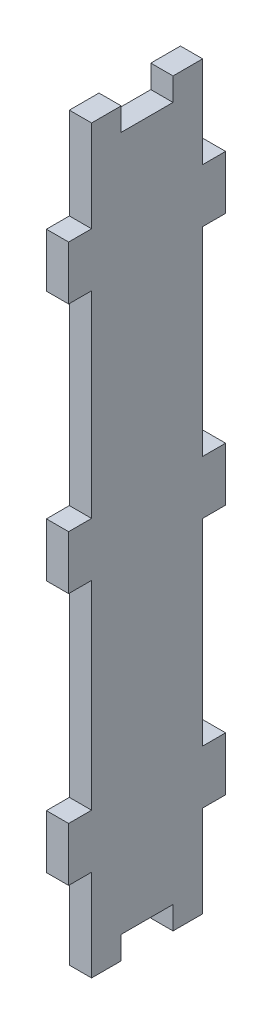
ISO-10303-21;
HEADER;
FILE_DESCRIPTION(('STEP AP214'),'2;1');
FILE_NAME('part.step','',(''),(''),'','','');
FILE_SCHEMA(('AUTOMOTIVE_DESIGN { 1 0 10303 214 1 1 1 1 }'));
ENDSEC;
DATA;
#1=APPLICATION_CONTEXT('core data for automotive mechanical design processes');
#2=APPLICATION_PROTOCOL_DEFINITION('international standard','automotive_design',2000,#1);
#3=PRODUCT_CONTEXT('',#1,'mechanical');
#4=PRODUCT('Part','Part','',(#3));
#5=PRODUCT_RELATED_PRODUCT_CATEGORY('part','',(#4));
#6=PRODUCT_DEFINITION_FORMATION('','',#4);
#7=PRODUCT_DEFINITION_CONTEXT('part definition',#1,'design');
#8=PRODUCT_DEFINITION('design','',#6,#7);
#9=PRODUCT_DEFINITION_SHAPE('','',#8);
#10=(LENGTH_UNIT() NAMED_UNIT(*) SI_UNIT(.MILLI.,.METRE.));
#11=(NAMED_UNIT(*) PLANE_ANGLE_UNIT() SI_UNIT($,.RADIAN.));
#12=(NAMED_UNIT(*) SI_UNIT($,.STERADIAN.) SOLID_ANGLE_UNIT());
#13=UNCERTAINTY_MEASURE_WITH_UNIT(LENGTH_MEASURE(1.E-05),#10,'distance_accuracy_value','');
#14=(GEOMETRIC_REPRESENTATION_CONTEXT(3) GLOBAL_UNCERTAINTY_ASSIGNED_CONTEXT((#13)) GLOBAL_UNIT_ASSIGNED_CONTEXT((#10,
#11,#12)) REPRESENTATION_CONTEXT('',''));
#15=CARTESIAN_POINT('',(0.,0.,0.));
#16=DIRECTION('',(0.,0.,1.));
#17=DIRECTION('',(1.,0.,0.));
#18=AXIS2_PLACEMENT_3D('',#15,#16,#17);
#19=CARTESIAN_POINT('',(6.,-100.,15.));
#20=DIRECTION('',(0.,1.,0.));
#21=DIRECTION('',(0.,0.,1.));
#22=AXIS2_PLACEMENT_3D('',#19,#20,#21);
#23=PLANE('',#22);
#24=DIRECTION('',(0.,0.,-1.));
#25=VECTOR('',#24,1.);
#26=CARTESIAN_POINT('',(0.,-100.,15.));
#27=LINE('',#26,#25);
#28=CARTESIAN_POINT('',(0.,-100.,15.));
#29=VERTEX_POINT('',#28);
#30=CARTESIAN_POINT('',(0.,-100.,6.9999999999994));
#31=VERTEX_POINT('',#30);
#32=EDGE_CURVE('E514',#29,#31,#27,.T.);
#33=ORIENTED_EDGE('',*,*,#32,.T.);
#34=DIRECTION('',(1.,0.,0.));
#35=VECTOR('',#34,1.);
#36=CARTESIAN_POINT('',(0.,-100.,6.9999999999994));
#37=LINE('',#36,#35);
#38=CARTESIAN_POINT('',(6.,-100.,6.9999999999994));
#39=VERTEX_POINT('',#38);
#40=EDGE_CURVE('E315',#31,#39,#37,.T.);
#41=ORIENTED_EDGE('',*,*,#40,.T.);
#42=DIRECTION('',(0.,0.,-1.));
#43=VECTOR('',#42,1.);
#44=CARTESIAN_POINT('',(6.,-100.,15.));
#45=LINE('',#44,#43);
#46=CARTESIAN_POINT('',(6.,-100.,15.));
#47=VERTEX_POINT('',#46);
#48=EDGE_CURVE('E496',#47,#39,#45,.T.);
#49=ORIENTED_EDGE('',*,*,#48,.F.);
#50=DIRECTION('',(-1.,0.,0.));
#51=VECTOR('',#50,1.);
#52=CARTESIAN_POINT('',(6.,-100.,15.));
#53=LINE('',#52,#51);
#54=EDGE_CURVE('E11',#47,#29,#53,.T.);
#55=ORIENTED_EDGE('',*,*,#54,.T.);
#56=EDGE_LOOP('',(#33,#41,#49,#55));
#57=FACE_BOUND('',#56,.T.);
#58=ADVANCED_FACE('F37',(#57),#23,.F.);
#59=CARTESIAN_POINT('',(6.,100.,15.));
#60=DIRECTION('',(0.,-1.,0.));
#61=DIRECTION('',(0.,0.,-1.));
#62=AXIS2_PLACEMENT_3D('',#59,#60,#61);
#63=PLANE('',#62);
#64=DIRECTION('',(0.,0.,1.));
#65=VECTOR('',#64,1.);
#66=CARTESIAN_POINT('',(6.,100.,15.));
#67=LINE('',#66,#65);
#68=CARTESIAN_POINT('',(6.,100.,7.));
#69=VERTEX_POINT('',#68);
#70=CARTESIAN_POINT('',(6.,100.,15.));
#71=VERTEX_POINT('',#70);
#72=EDGE_CURVE('E503',#69,#71,#67,.T.);
#73=ORIENTED_EDGE('',*,*,#72,.F.);
#74=DIRECTION('',(1.,0.,0.));
#75=VECTOR('',#74,1.);
#76=CARTESIAN_POINT('',(0.,100.,7.));
#77=LINE('',#76,#75);
#78=CARTESIAN_POINT('',(0.,100.,7.));
#79=VERTEX_POINT('',#78);
#80=EDGE_CURVE('E300',#79,#69,#77,.T.);
#81=ORIENTED_EDGE('',*,*,#80,.F.);
#82=DIRECTION('',(0.,0.,1.));
#83=VECTOR('',#82,1.);
#84=CARTESIAN_POINT('',(0.,100.,15.));
#85=LINE('',#84,#83);
#86=CARTESIAN_POINT('',(0.,100.,15.));
#87=VERTEX_POINT('',#86);
#88=EDGE_CURVE('E290',#79,#87,#85,.T.);
#89=ORIENTED_EDGE('',*,*,#88,.T.);
#90=DIRECTION('',(-1.,0.,0.));
#91=VECTOR('',#90,1.);
#92=CARTESIAN_POINT('',(6.,100.,15.));
#93=LINE('',#92,#91);
#94=EDGE_CURVE('E508',#71,#87,#93,.T.);
#95=ORIENTED_EDGE('',*,*,#94,.F.);
#96=EDGE_LOOP('',(#73,#81,#89,#95));
#97=FACE_BOUND('',#96,.T.);
#98=ADVANCED_FACE('F616',(#97),#63,.F.);
#99=CARTESIAN_POINT('',(6.,100.,-15.));
#100=DIRECTION('',(0.,0.,1.));
#101=DIRECTION('',(0.,-1.,0.));
#102=AXIS2_PLACEMENT_3D('',#99,#100,#101);
#103=PLANE('',#102);
#104=DIRECTION('',(0.,1.,0.));
#105=VECTOR('',#104,1.);
#106=CARTESIAN_POINT('',(6.,100.,-15.));
#107=LINE('',#106,#105);
#108=CARTESIAN_POINT('',(6.,75.2499999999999,-15.));
#109=VERTEX_POINT('',#108);
#110=CARTESIAN_POINT('',(6.,100.,-15.));
#111=VERTEX_POINT('',#110);
#112=EDGE_CURVE('E499',#109,#111,#107,.T.);
#113=ORIENTED_EDGE('',*,*,#112,.F.);
#114=DIRECTION('',(1.,0.,0.));
#115=VECTOR('',#114,1.);
#116=CARTESIAN_POINT('',(0.,75.2499999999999,-14.9999999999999));
#117=LINE('',#116,#115);
#118=CARTESIAN_POINT('',(0.,75.2499999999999,-14.9999999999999));
#119=VERTEX_POINT('',#118);
#120=EDGE_CURVE('E340',#119,#109,#117,.T.);
#121=ORIENTED_EDGE('',*,*,#120,.F.);
#122=DIRECTION('',(0.,1.,0.));
#123=VECTOR('',#122,1.);
#124=CARTESIAN_POINT('',(0.,100.,-15.));
#125=LINE('',#124,#123);
#126=CARTESIAN_POINT('',(0.,100.,-15.));
#127=VERTEX_POINT('',#126);
#128=EDGE_CURVE('E517',#119,#127,#125,.T.);
#129=ORIENTED_EDGE('',*,*,#128,.T.);
#130=DIRECTION('',(-1.,0.,0.));
#131=VECTOR('',#130,1.);
#132=CARTESIAN_POINT('',(6.,100.,-15.));
#133=LINE('',#132,#131);
#134=EDGE_CURVE('E527',#111,#127,#133,.T.);
#135=ORIENTED_EDGE('',*,*,#134,.F.);
#136=EDGE_LOOP('',(#113,#121,#129,#135));
#137=FACE_BOUND('',#136,.T.);
#138=ADVANCED_FACE('F620',(#137),#103,.F.);
#139=CARTESIAN_POINT('',(0.,6.99999999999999,-14.9999999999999));
#140=VERTEX_POINT('',#139);
#141=CARTESIAN_POINT('',(0.,60.75,-15.));
#142=VERTEX_POINT('',#141);
#143=EDGE_CURVE('E675',#140,#142,#125,.T.);
#144=ORIENTED_EDGE('',*,*,#143,.T.);
#145=DIRECTION('',(1.,0.,0.));
#146=VECTOR('',#145,1.);
#147=CARTESIAN_POINT('',(0.,60.75,-15.0000000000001));
#148=LINE('',#147,#146);
#149=CARTESIAN_POINT('',(6.,60.75,-15.));
#150=VERTEX_POINT('',#149);
#151=EDGE_CURVE('E353',#142,#150,#148,.T.);
#152=ORIENTED_EDGE('',*,*,#151,.T.);
#153=CARTESIAN_POINT('',(6.,6.99999999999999,-15.));
#154=VERTEX_POINT('',#153);
#155=EDGE_CURVE('E690',#154,#150,#107,.T.);
#156=ORIENTED_EDGE('',*,*,#155,.F.);
#157=DIRECTION('',(1.,0.,0.));
#158=VECTOR('',#157,1.);
#159=CARTESIAN_POINT('',(0.,6.99999999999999,-14.9999999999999));
#160=LINE('',#159,#158);
#161=EDGE_CURVE('E367',#140,#154,#160,.T.);
#162=ORIENTED_EDGE('',*,*,#161,.F.);
#163=EDGE_LOOP('',(#144,#152,#156,#162));
#164=FACE_BOUND('',#163,.T.);
#165=ADVANCED_FACE('F640',(#164),#103,.F.);
#166=CARTESIAN_POINT('',(0.,-60.7500000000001,-14.9999999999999));
#167=VERTEX_POINT('',#166);
#168=CARTESIAN_POINT('',(0.,-7.49999999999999,-15.));
#169=VERTEX_POINT('',#168);
#170=EDGE_CURVE('E521',#167,#169,#125,.T.);
#171=ORIENTED_EDGE('',*,*,#170,.T.);
#172=DIRECTION('',(1.,0.,0.));
#173=VECTOR('',#172,1.);
#174=CARTESIAN_POINT('',(0.,-7.49999999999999,-15.0000000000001));
#175=LINE('',#174,#173);
#176=CARTESIAN_POINT('',(6.,-7.49999999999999,-15.));
#177=VERTEX_POINT('',#176);
#178=EDGE_CURVE('E380',#169,#177,#175,.T.);
#179=ORIENTED_EDGE('',*,*,#178,.T.);
#180=CARTESIAN_POINT('',(6.,-60.7500000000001,-14.9999999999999));
#181=VERTEX_POINT('',#180);
#182=EDGE_CURVE('E504',#181,#177,#107,.T.);
#183=ORIENTED_EDGE('',*,*,#182,.F.);
#184=DIRECTION('',(1.,0.,0.));
#185=VECTOR('',#184,1.);
#186=CARTESIAN_POINT('',(0.,-60.7500000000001,-14.9999999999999));
#187=LINE('',#186,#185);
#188=EDGE_CURVE('E393',#167,#181,#187,.T.);
#189=ORIENTED_EDGE('',*,*,#188,.F.);
#190=EDGE_LOOP('',(#171,#179,#183,#189));
#191=FACE_BOUND('',#190,.T.);
#192=ADVANCED_FACE('F630',(#191),#103,.F.);
#193=CARTESIAN_POINT('',(6.,100.,15.));
#194=DIRECTION('',(0.,0.,-1.));
#195=DIRECTION('',(0.,1.,0.));
#196=AXIS2_PLACEMENT_3D('',#193,#194,#195);
#197=PLANE('',#196);
#198=DIRECTION('',(0.,-1.,0.));
#199=VECTOR('',#198,1.);
#200=CARTESIAN_POINT('',(6.,100.,15.));
#201=LINE('',#200,#199);
#202=CARTESIAN_POINT('',(6.,-75.25,15.));
#203=VERTEX_POINT('',#202);
#204=EDGE_CURVE('E495',#203,#47,#201,.T.);
#205=ORIENTED_EDGE('',*,*,#204,.F.);
#206=DIRECTION('',(1.,0.,0.));
#207=VECTOR('',#206,1.);
#208=CARTESIAN_POINT('',(0.,-75.25,14.9999999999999));
#209=LINE('',#208,#207);
#210=CARTESIAN_POINT('',(0.,-75.25,14.9999999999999));
#211=VERTEX_POINT('',#210);
#212=EDGE_CURVE('E420',#211,#203,#209,.T.);
#213=ORIENTED_EDGE('',*,*,#212,.F.);
#214=DIRECTION('',(0.,-1.,0.));
#215=VECTOR('',#214,1.);
#216=CARTESIAN_POINT('',(0.,100.,15.));
#217=LINE('',#216,#215);
#218=EDGE_CURVE('E483',#211,#29,#217,.T.);
#219=ORIENTED_EDGE('',*,*,#218,.T.);
#220=ORIENTED_EDGE('',*,*,#54,.F.);
#221=EDGE_LOOP('',(#205,#213,#219,#220));
#222=FACE_BOUND('',#221,.T.);
#223=ADVANCED_FACE('F559',(#222),#197,.F.);
#224=CARTESIAN_POINT('',(0.,-6.99999999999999,14.9999999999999));
#225=VERTEX_POINT('',#224);
#226=CARTESIAN_POINT('',(0.,-60.75,15.));
#227=VERTEX_POINT('',#226);
#228=EDGE_CURVE('E562',#225,#227,#217,.T.);
#229=ORIENTED_EDGE('',*,*,#228,.T.);
#230=DIRECTION('',(1.,0.,0.));
#231=VECTOR('',#230,1.);
#232=CARTESIAN_POINT('',(0.,-60.75,15.));
#233=LINE('',#232,#231);
#234=CARTESIAN_POINT('',(6.,-60.75,15.));
#235=VERTEX_POINT('',#234);
#236=EDGE_CURVE('E433',#227,#235,#233,.T.);
#237=ORIENTED_EDGE('',*,*,#236,.T.);
#238=CARTESIAN_POINT('',(6.,-6.99999999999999,15.));
#239=VERTEX_POINT('',#238);
#240=EDGE_CURVE('E585',#239,#235,#201,.T.);
#241=ORIENTED_EDGE('',*,*,#240,.F.);
#242=DIRECTION('',(1.,0.,0.));
#243=VECTOR('',#242,1.);
#244=CARTESIAN_POINT('',(0.,-6.99999999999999,14.9999999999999));
#245=LINE('',#244,#243);
#246=EDGE_CURVE('E447',#225,#239,#245,.T.);
#247=ORIENTED_EDGE('',*,*,#246,.F.);
#248=EDGE_LOOP('',(#229,#237,#241,#247));
#249=FACE_BOUND('',#248,.T.);
#250=ADVANCED_FACE('F599',(#249),#197,.F.);
#251=CARTESIAN_POINT('',(0.,60.75,14.9999999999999));
#252=VERTEX_POINT('',#251);
#253=CARTESIAN_POINT('',(0.,7.49999999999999,15.));
#254=VERTEX_POINT('',#253);
#255=EDGE_CURVE('E513',#252,#254,#217,.T.);
#256=ORIENTED_EDGE('',*,*,#255,.T.);
#257=DIRECTION('',(1.,0.,0.));
#258=VECTOR('',#257,1.);
#259=CARTESIAN_POINT('',(0.,7.49999999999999,15.));
#260=LINE('',#259,#258);
#261=CARTESIAN_POINT('',(6.,7.49999999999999,15.));
#262=VERTEX_POINT('',#261);
#263=EDGE_CURVE('E460',#254,#262,#260,.T.);
#264=ORIENTED_EDGE('',*,*,#263,.T.);
#265=CARTESIAN_POINT('',(6.,60.75,14.9999999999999));
#266=VERTEX_POINT('',#265);
#267=EDGE_CURVE('E494',#266,#262,#201,.T.);
#268=ORIENTED_EDGE('',*,*,#267,.F.);
#269=DIRECTION('',(1.,0.,0.));
#270=VECTOR('',#269,1.);
#271=CARTESIAN_POINT('',(0.,60.75,14.9999999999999));
#272=LINE('',#271,#270);
#273=EDGE_CURVE('E473',#252,#266,#272,.T.);
#274=ORIENTED_EDGE('',*,*,#273,.F.);
#275=EDGE_LOOP('',(#256,#264,#268,#274));
#276=FACE_BOUND('',#275,.T.);
#277=ADVANCED_FACE('F570',(#276),#197,.F.);
#278=CARTESIAN_POINT('',(0.,75.25,15.));
#279=VERTEX_POINT('',#278);
#280=EDGE_CURVE('E509',#87,#279,#217,.T.);
#281=ORIENTED_EDGE('',*,*,#280,.T.);
#282=DIRECTION('',(1.,0.,0.));
#283=VECTOR('',#282,1.);
#284=CARTESIAN_POINT('',(0.,75.25,15.));
#285=LINE('',#284,#283);
#286=CARTESIAN_POINT('',(6.,75.25,15.));
#287=VERTEX_POINT('',#286);
#288=EDGE_CURVE('E486',#279,#287,#285,.T.);
#289=ORIENTED_EDGE('',*,*,#288,.T.);
#290=EDGE_CURVE('E490',#71,#287,#201,.T.);
#291=ORIENTED_EDGE('',*,*,#290,.F.);
#292=ORIENTED_EDGE('',*,*,#94,.T.);
#293=EDGE_LOOP('',(#281,#289,#291,#292));
#294=FACE_BOUND('',#293,.T.);
#295=ADVANCED_FACE('F39',(#294),#197,.F.);
#296=CARTESIAN_POINT('',(6.,-99.9999999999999,-7.00000000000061));
#297=VERTEX_POINT('',#296);
#298=CARTESIAN_POINT('',(6.,-100.,-15.));
#299=VERTEX_POINT('',#298);
#300=EDGE_CURVE('E493',#297,#299,#45,.T.);
#301=ORIENTED_EDGE('',*,*,#300,.F.);
#302=DIRECTION('',(1.,0.,0.));
#303=VECTOR('',#302,1.);
#304=CARTESIAN_POINT('',(0.,-99.9999999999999,-7.00000000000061));
#305=LINE('',#304,#303);
#306=CARTESIAN_POINT('',(0.,-99.9999999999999,-7.00000000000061));
#307=VERTEX_POINT('',#306);
#308=EDGE_CURVE('E326',#307,#297,#305,.T.);
#309=ORIENTED_EDGE('',*,*,#308,.F.);
#310=CARTESIAN_POINT('',(0.,-100.,-15.));
#311=VERTEX_POINT('',#310);
#312=EDGE_CURVE('E512',#307,#311,#27,.T.);
#313=ORIENTED_EDGE('',*,*,#312,.T.);
#314=DIRECTION('',(-1.,0.,0.));
#315=VECTOR('',#314,1.);
#316=CARTESIAN_POINT('',(6.,-100.,-15.));
#317=LINE('',#316,#315);
#318=EDGE_CURVE('E45',#299,#311,#317,.T.);
#319=ORIENTED_EDGE('',*,*,#318,.F.);
#320=EDGE_LOOP('',(#301,#309,#313,#319));
#321=FACE_BOUND('',#320,.T.);
#322=ADVANCED_FACE('F549',(#321),#23,.F.);
#323=CARTESIAN_POINT('',(0.,-75.2500000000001,-15.0000000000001));
#324=VERTEX_POINT('',#323);
#325=EDGE_CURVE('E518',#311,#324,#125,.T.);
#326=ORIENTED_EDGE('',*,*,#325,.T.);
#327=DIRECTION('',(1.,0.,0.));
#328=VECTOR('',#327,1.);
#329=CARTESIAN_POINT('',(0.,-75.2500000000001,-15.0000000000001));
#330=LINE('',#329,#328);
#331=CARTESIAN_POINT('',(6.,-75.2500000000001,-15.));
#332=VERTEX_POINT('',#331);
#333=EDGE_CURVE('E406',#324,#332,#330,.T.);
#334=ORIENTED_EDGE('',*,*,#333,.T.);
#335=EDGE_CURVE('E500',#299,#332,#107,.T.);
#336=ORIENTED_EDGE('',*,*,#335,.F.);
#337=ORIENTED_EDGE('',*,*,#318,.T.);
#338=EDGE_LOOP('',(#326,#334,#336,#337));
#339=FACE_BOUND('',#338,.T.);
#340=ADVANCED_FACE('F534',(#339),#103,.F.);
#341=CARTESIAN_POINT('',(0.,100.,-7.));
#342=VERTEX_POINT('',#341);
#343=EDGE_CURVE('E522',#127,#342,#85,.T.);
#344=ORIENTED_EDGE('',*,*,#343,.T.);
#345=DIRECTION('',(1.,0.,0.));
#346=VECTOR('',#345,1.);
#347=CARTESIAN_POINT('',(0.,100.,-7.));
#348=LINE('',#347,#346);
#349=CARTESIAN_POINT('',(6.,100.,-7.));
#350=VERTEX_POINT('',#349);
#351=EDGE_CURVE('E303',#342,#350,#348,.T.);
#352=ORIENTED_EDGE('',*,*,#351,.T.);
#353=EDGE_CURVE('E505',#111,#350,#67,.T.);
#354=ORIENTED_EDGE('',*,*,#353,.F.);
#355=ORIENTED_EDGE('',*,*,#134,.T.);
#356=EDGE_LOOP('',(#344,#352,#354,#355));
#357=FACE_BOUND('',#356,.T.);
#358=ADVANCED_FACE('F623',(#357),#63,.F.);
#359=CARTESIAN_POINT('',(6.,0.,0.));
#360=DIRECTION('',(1.,0.,0.));
#361=DIRECTION('',(0.,0.,-1.));
#362=AXIS2_PLACEMENT_3D('',#359,#360,#361);
#363=PLANE('',#362);
#364=DIRECTION('',(0.,-1.,0.));
#365=VECTOR('',#364,1.);
#366=CARTESIAN_POINT('',(6.,100.,7.));
#367=LINE('',#366,#365);
#368=CARTESIAN_POINT('',(6.,93.8,7.));
#369=VERTEX_POINT('',#368);
#370=EDGE_CURVE('E276',#69,#369,#367,.T.);
#371=ORIENTED_EDGE('',*,*,#370,.F.);
#372=ORIENTED_EDGE('',*,*,#72,.T.);
#373=ORIENTED_EDGE('',*,*,#290,.T.);
#374=DIRECTION('',(0.,0.,1.));
#375=VECTOR('',#374,1.);
#376=CARTESIAN_POINT('',(6.,75.25,15.));
#377=LINE('',#376,#375);
#378=CARTESIAN_POINT('',(6.,75.25,21.2));
#379=VERTEX_POINT('',#378);
#380=EDGE_CURVE('E476',#287,#379,#377,.T.);
#381=ORIENTED_EDGE('',*,*,#380,.T.);
#382=DIRECTION('',(0.,-1.,0.));
#383=VECTOR('',#382,1.);
#384=CARTESIAN_POINT('',(6.,75.25,21.2));
#385=LINE('',#384,#383);
#386=CARTESIAN_POINT('',(6.,60.75,21.1999999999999));
#387=VERTEX_POINT('',#386);
#388=EDGE_CURVE('E467',#379,#387,#385,.T.);
#389=ORIENTED_EDGE('',*,*,#388,.T.);
#390=DIRECTION('',(0.,0.,-1.));
#391=VECTOR('',#390,1.);
#392=CARTESIAN_POINT('',(6.,60.75,21.1999999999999));
#393=LINE('',#392,#391);
#394=EDGE_CURVE('E457',#387,#266,#393,.T.);
#395=ORIENTED_EDGE('',*,*,#394,.T.);
#396=ORIENTED_EDGE('',*,*,#267,.T.);
#397=DIRECTION('',(0.,0.,1.));
#398=VECTOR('',#397,1.);
#399=CARTESIAN_POINT('',(6.,7.49999999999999,15.));
#400=LINE('',#399,#398);
#401=CARTESIAN_POINT('',(6.,7.49999999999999,21.2));
#402=VERTEX_POINT('',#401);
#403=EDGE_CURVE('E450',#262,#402,#400,.T.);
#404=ORIENTED_EDGE('',*,*,#403,.T.);
#405=DIRECTION('',(0.,-1.,0.));
#406=VECTOR('',#405,1.);
#407=CARTESIAN_POINT('',(6.,7.49999999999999,21.2));
#408=LINE('',#407,#406);
#409=CARTESIAN_POINT('',(6.,-7.00000000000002,21.1999999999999));
#410=VERTEX_POINT('',#409);
#411=EDGE_CURVE('E441',#402,#410,#408,.T.);
#412=ORIENTED_EDGE('',*,*,#411,.T.);
#413=DIRECTION('',(0.,0.,-1.));
#414=VECTOR('',#413,1.);
#415=CARTESIAN_POINT('',(6.,-7.00000000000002,21.1999999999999));
#416=LINE('',#415,#414);
#417=EDGE_CURVE('E430',#410,#239,#416,.T.);
#418=ORIENTED_EDGE('',*,*,#417,.T.);
#419=ORIENTED_EDGE('',*,*,#240,.T.);
#420=DIRECTION('',(0.,0.,1.));
#421=VECTOR('',#420,1.);
#422=CARTESIAN_POINT('',(6.,-60.75,15.));
#423=LINE('',#422,#421);
#424=CARTESIAN_POINT('',(6.,-60.75,21.2));
#425=VERTEX_POINT('',#424);
#426=EDGE_CURVE('E423',#235,#425,#423,.T.);
#427=ORIENTED_EDGE('',*,*,#426,.T.);
#428=DIRECTION('',(0.,-1.,0.));
#429=VECTOR('',#428,1.);
#430=CARTESIAN_POINT('',(6.,-60.75,21.2));
#431=LINE('',#430,#429);
#432=CARTESIAN_POINT('',(6.,-75.25,21.1999999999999));
#433=VERTEX_POINT('',#432);
#434=EDGE_CURVE('E414',#425,#433,#431,.T.);
#435=ORIENTED_EDGE('',*,*,#434,.T.);
#436=DIRECTION('',(0.,0.,-1.));
#437=VECTOR('',#436,1.);
#438=CARTESIAN_POINT('',(6.,-75.25,21.1999999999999));
#439=LINE('',#438,#437);
#440=EDGE_CURVE('E403',#433,#203,#439,.T.);
#441=ORIENTED_EDGE('',*,*,#440,.T.);
#442=ORIENTED_EDGE('',*,*,#204,.T.);
#443=ORIENTED_EDGE('',*,*,#48,.T.);
#444=DIRECTION('',(0.,-1.,0.));
#445=VECTOR('',#444,1.);
#446=CARTESIAN_POINT('',(6.,-100.,6.9999999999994));
#447=LINE('',#446,#445);
#448=CARTESIAN_POINT('',(6.,-93.8000000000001,6.99999999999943));
#449=VERTEX_POINT('',#448);
#450=EDGE_CURVE('E316',#449,#39,#447,.T.);
#451=ORIENTED_EDGE('',*,*,#450,.F.);
#452=DIRECTION('',(0.,0.,1.));
#453=VECTOR('',#452,1.);
#454=CARTESIAN_POINT('',(6.,-93.8000000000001,6.99999999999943));
#455=LINE('',#454,#453);
#456=CARTESIAN_POINT('',(6.,-93.8,-7.00000000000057));
#457=VERTEX_POINT('',#456);
#458=EDGE_CURVE('E311',#457,#449,#455,.T.);
#459=ORIENTED_EDGE('',*,*,#458,.F.);
#460=DIRECTION('',(0.,1.,0.));
#461=VECTOR('',#460,1.);
#462=CARTESIAN_POINT('',(6.,-99.9999999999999,-7.00000000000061));
#463=LINE('',#462,#461);
#464=EDGE_CURVE('E318',#297,#457,#463,.T.);
#465=ORIENTED_EDGE('',*,*,#464,.F.);
#466=ORIENTED_EDGE('',*,*,#300,.T.);
#467=ORIENTED_EDGE('',*,*,#335,.T.);
#468=DIRECTION('',(0.,0.,-1.));
#469=VECTOR('',#468,1.);
#470=CARTESIAN_POINT('',(6.,-75.2500000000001,-15.0000000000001));
#471=LINE('',#470,#469);
#472=CARTESIAN_POINT('',(6.,-75.25,-21.2));
#473=VERTEX_POINT('',#472);
#474=EDGE_CURVE('E396',#332,#473,#471,.T.);
#475=ORIENTED_EDGE('',*,*,#474,.T.);
#476=DIRECTION('',(0.,1.,0.));
#477=VECTOR('',#476,1.);
#478=CARTESIAN_POINT('',(6.,-75.25,-21.2));
#479=LINE('',#478,#477);
#480=CARTESIAN_POINT('',(6.,-60.75,-21.1999999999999));
#481=VERTEX_POINT('',#480);
#482=EDGE_CURVE('E387',#473,#481,#479,.T.);
#483=ORIENTED_EDGE('',*,*,#482,.T.);
#484=DIRECTION('',(0.,0.,1.));
#485=VECTOR('',#484,1.);
#486=CARTESIAN_POINT('',(6.,-60.75,-21.1999999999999));
#487=LINE('',#486,#485);
#488=EDGE_CURVE('E377',#481,#181,#487,.T.);
#489=ORIENTED_EDGE('',*,*,#488,.T.);
#490=ORIENTED_EDGE('',*,*,#182,.T.);
#491=DIRECTION('',(0.,0.,-1.));
#492=VECTOR('',#491,1.);
#493=CARTESIAN_POINT('',(6.,-7.49999999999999,-15.0000000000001));
#494=LINE('',#493,#492);
#495=CARTESIAN_POINT('',(6.,-7.49999999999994,-21.2));
#496=VERTEX_POINT('',#495);
#497=EDGE_CURVE('E370',#177,#496,#494,.T.);
#498=ORIENTED_EDGE('',*,*,#497,.T.);
#499=DIRECTION('',(0.,1.,0.));
#500=VECTOR('',#499,1.);
#501=CARTESIAN_POINT('',(6.,-7.49999999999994,-21.2));
#502=LINE('',#501,#500);
#503=CARTESIAN_POINT('',(6.,7.00000000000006,-21.1999999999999));
#504=VERTEX_POINT('',#503);
#505=EDGE_CURVE('E361',#496,#504,#502,.T.);
#506=ORIENTED_EDGE('',*,*,#505,.T.);
#507=DIRECTION('',(0.,0.,1.));
#508=VECTOR('',#507,1.);
#509=CARTESIAN_POINT('',(6.,7.00000000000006,-21.1999999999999));
#510=LINE('',#509,#508);
#511=EDGE_CURVE('E350',#504,#154,#510,.T.);
#512=ORIENTED_EDGE('',*,*,#511,.T.);
#513=ORIENTED_EDGE('',*,*,#155,.T.);
#514=DIRECTION('',(0.,0.,-1.));
#515=VECTOR('',#514,1.);
#516=CARTESIAN_POINT('',(6.,60.75,-15.0000000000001));
#517=LINE('',#516,#515);
#518=CARTESIAN_POINT('',(6.,60.75,-21.2));
#519=VERTEX_POINT('',#518);
#520=EDGE_CURVE('E343',#150,#519,#517,.T.);
#521=ORIENTED_EDGE('',*,*,#520,.T.);
#522=DIRECTION('',(0.,1.,0.));
#523=VECTOR('',#522,1.);
#524=CARTESIAN_POINT('',(6.,60.75,-21.2));
#525=LINE('',#524,#523);
#526=CARTESIAN_POINT('',(6.,75.25,-21.1999999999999));
#527=VERTEX_POINT('',#526);
#528=EDGE_CURVE('E334',#519,#527,#525,.T.);
#529=ORIENTED_EDGE('',*,*,#528,.T.);
#530=DIRECTION('',(0.,0.,1.));
#531=VECTOR('',#530,1.);
#532=CARTESIAN_POINT('',(6.,75.25,-21.1999999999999));
#533=LINE('',#532,#531);
#534=EDGE_CURVE('E302',#527,#109,#533,.T.);
#535=ORIENTED_EDGE('',*,*,#534,.T.);
#536=ORIENTED_EDGE('',*,*,#112,.T.);
#537=ORIENTED_EDGE('',*,*,#353,.T.);
#538=DIRECTION('',(0.,1.,0.));
#539=VECTOR('',#538,1.);
#540=CARTESIAN_POINT('',(6.,100.,-7.));
#541=LINE('',#540,#539);
#542=CARTESIAN_POINT('',(6.,93.8,-7.));
#543=VERTEX_POINT('',#542);
#544=EDGE_CURVE('E291',#543,#350,#541,.T.);
#545=ORIENTED_EDGE('',*,*,#544,.F.);
#546=DIRECTION('',(0.,0.,-1.));
#547=VECTOR('',#546,1.);
#548=CARTESIAN_POINT('',(6.,93.8,7.));
#549=LINE('',#548,#547);
#550=EDGE_CURVE('E293',#369,#543,#549,.T.);
#551=ORIENTED_EDGE('',*,*,#550,.F.);
#552=EDGE_LOOP('',(#371,#372,#373,#381,#389,#395,#396,#404,#412,#418,#419,#427,#435,#441,#442,
#443,#451,#459,#465,#466,#467,#475,#483,#489,#490,#498,#506,#512,#513,#521,#529,#535,#536,#537,
#545,#551));
#553=FACE_BOUND('',#552,.T.);
#554=ADVANCED_FACE('F544',(#553),#363,.T.);
#555=CARTESIAN_POINT('',(0.,0.,0.));
#556=DIRECTION('',(1.,0.,0.));
#557=DIRECTION('',(0.,0.,-1.));
#558=AXIS2_PLACEMENT_3D('',#555,#556,#557);
#559=PLANE('',#558);
#560=ORIENTED_EDGE('',*,*,#88,.F.);
#561=DIRECTION('',(0.,-1.,0.));
#562=VECTOR('',#561,1.);
#563=CARTESIAN_POINT('',(0.,100.,7.));
#564=LINE('',#563,#562);
#565=CARTESIAN_POINT('',(0.,93.8,7.));
#566=VERTEX_POINT('',#565);
#567=EDGE_CURVE('E273',#79,#566,#564,.T.);
#568=ORIENTED_EDGE('',*,*,#567,.T.);
#569=DIRECTION('',(0.,0.,-1.));
#570=VECTOR('',#569,1.);
#571=CARTESIAN_POINT('',(0.,93.8,7.));
#572=LINE('',#571,#570);
#573=CARTESIAN_POINT('',(0.,93.8,-7.));
#574=VERTEX_POINT('',#573);
#575=EDGE_CURVE('E283',#566,#574,#572,.T.);
#576=ORIENTED_EDGE('',*,*,#575,.T.);
#577=DIRECTION('',(0.,1.,0.));
#578=VECTOR('',#577,1.);
#579=CARTESIAN_POINT('',(0.,100.,-7.));
#580=LINE('',#579,#578);
#581=EDGE_CURVE('E52',#574,#342,#580,.T.);
#582=ORIENTED_EDGE('',*,*,#581,.T.);
#583=ORIENTED_EDGE('',*,*,#343,.F.);
#584=ORIENTED_EDGE('',*,*,#128,.F.);
#585=DIRECTION('',(0.,0.,1.));
#586=VECTOR('',#585,1.);
#587=CARTESIAN_POINT('',(0.,75.25,-21.1999999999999));
#588=LINE('',#587,#586);
#589=CARTESIAN_POINT('',(0.,75.25,-21.1999999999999));
#590=VERTEX_POINT('',#589);
#591=EDGE_CURVE('E330',#590,#119,#588,.T.);
#592=ORIENTED_EDGE('',*,*,#591,.F.);
#593=DIRECTION('',(0.,1.,0.));
#594=VECTOR('',#593,1.);
#595=CARTESIAN_POINT('',(0.,60.75,-21.2));
#596=LINE('',#595,#594);
#597=CARTESIAN_POINT('',(0.,60.75,-21.2));
#598=VERTEX_POINT('',#597);
#599=EDGE_CURVE('E337',#598,#590,#596,.T.);
#600=ORIENTED_EDGE('',*,*,#599,.F.);
#601=DIRECTION('',(0.,0.,-1.));
#602=VECTOR('',#601,1.);
#603=CARTESIAN_POINT('',(0.,60.75,-15.0000000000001));
#604=LINE('',#603,#602);
#605=EDGE_CURVE('E333',#142,#598,#604,.T.);
#606=ORIENTED_EDGE('',*,*,#605,.F.);
#607=ORIENTED_EDGE('',*,*,#143,.F.);
#608=DIRECTION('',(0.,0.,1.));
#609=VECTOR('',#608,1.);
#610=CARTESIAN_POINT('',(0.,7.00000000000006,-21.1999999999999));
#611=LINE('',#610,#609);
#612=CARTESIAN_POINT('',(0.,7.00000000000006,-21.1999999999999));
#613=VERTEX_POINT('',#612);
#614=EDGE_CURVE('E357',#613,#140,#611,.T.);
#615=ORIENTED_EDGE('',*,*,#614,.F.);
#616=DIRECTION('',(0.,1.,0.));
#617=VECTOR('',#616,1.);
#618=CARTESIAN_POINT('',(0.,-7.49999999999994,-21.2));
#619=LINE('',#618,#617);
#620=CARTESIAN_POINT('',(0.,-7.49999999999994,-21.2));
#621=VERTEX_POINT('',#620);
#622=EDGE_CURVE('E364',#621,#613,#619,.T.);
#623=ORIENTED_EDGE('',*,*,#622,.F.);
#624=DIRECTION('',(0.,0.,-1.));
#625=VECTOR('',#624,1.);
#626=CARTESIAN_POINT('',(0.,-7.49999999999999,-15.0000000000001));
#627=LINE('',#626,#625);
#628=EDGE_CURVE('E360',#169,#621,#627,.T.);
#629=ORIENTED_EDGE('',*,*,#628,.F.);
#630=ORIENTED_EDGE('',*,*,#170,.F.);
#631=DIRECTION('',(0.,0.,1.));
#632=VECTOR('',#631,1.);
#633=CARTESIAN_POINT('',(0.,-60.75,-21.1999999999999));
#634=LINE('',#633,#632);
#635=CARTESIAN_POINT('',(0.,-60.75,-21.1999999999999));
#636=VERTEX_POINT('',#635);
#637=EDGE_CURVE('E384',#636,#167,#634,.T.);
#638=ORIENTED_EDGE('',*,*,#637,.F.);
#639=DIRECTION('',(0.,1.,0.));
#640=VECTOR('',#639,1.);
#641=CARTESIAN_POINT('',(0.,-75.25,-21.2));
#642=LINE('',#641,#640);
#643=CARTESIAN_POINT('',(0.,-75.25,-21.2));
#644=VERTEX_POINT('',#643);
#645=EDGE_CURVE('E390',#644,#636,#642,.T.);
#646=ORIENTED_EDGE('',*,*,#645,.F.);
#647=DIRECTION('',(0.,0.,-1.));
#648=VECTOR('',#647,1.);
#649=CARTESIAN_POINT('',(0.,-75.2500000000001,-15.0000000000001));
#650=LINE('',#649,#648);
#651=EDGE_CURVE('E386',#324,#644,#650,.T.);
#652=ORIENTED_EDGE('',*,*,#651,.F.);
#653=ORIENTED_EDGE('',*,*,#325,.F.);
#654=ORIENTED_EDGE('',*,*,#312,.F.);
#655=DIRECTION('',(0.,1.,0.));
#656=VECTOR('',#655,1.);
#657=CARTESIAN_POINT('',(0.,-99.9999999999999,-7.00000000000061));
#658=LINE('',#657,#656);
#659=CARTESIAN_POINT('',(0.,-93.8,-7.00000000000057));
#660=VERTEX_POINT('',#659);
#661=EDGE_CURVE('E310',#307,#660,#658,.T.);
#662=ORIENTED_EDGE('',*,*,#661,.T.);
#663=DIRECTION('',(0.,0.,1.));
#664=VECTOR('',#663,1.);
#665=CARTESIAN_POINT('',(0.,-93.8000000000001,6.99999999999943));
#666=LINE('',#665,#664);
#667=CARTESIAN_POINT('',(0.,-93.8000000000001,6.99999999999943));
#668=VERTEX_POINT('',#667);
#669=EDGE_CURVE('E60',#660,#668,#666,.T.);
#670=ORIENTED_EDGE('',*,*,#669,.T.);
#671=DIRECTION('',(0.,-1.,0.));
#672=VECTOR('',#671,1.);
#673=CARTESIAN_POINT('',(0.,-100.,6.9999999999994));
#674=LINE('',#673,#672);
#675=EDGE_CURVE('E307',#668,#31,#674,.T.);
#676=ORIENTED_EDGE('',*,*,#675,.T.);
#677=ORIENTED_EDGE('',*,*,#32,.F.);
#678=ORIENTED_EDGE('',*,*,#218,.F.);
#679=DIRECTION('',(0.,0.,-1.));
#680=VECTOR('',#679,1.);
#681=CARTESIAN_POINT('',(0.,-75.25,21.1999999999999));
#682=LINE('',#681,#680);
#683=CARTESIAN_POINT('',(0.,-75.25,21.1999999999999));
#684=VERTEX_POINT('',#683);
#685=EDGE_CURVE('E410',#684,#211,#682,.T.);
#686=ORIENTED_EDGE('',*,*,#685,.F.);
#687=DIRECTION('',(0.,-1.,0.));
#688=VECTOR('',#687,1.);
#689=CARTESIAN_POINT('',(0.,-60.75,21.2));
#690=LINE('',#689,#688);
#691=CARTESIAN_POINT('',(0.,-60.75,21.2));
#692=VERTEX_POINT('',#691);
#693=EDGE_CURVE('E417',#692,#684,#690,.T.);
#694=ORIENTED_EDGE('',*,*,#693,.F.);
#695=DIRECTION('',(0.,0.,1.));
#696=VECTOR('',#695,1.);
#697=CARTESIAN_POINT('',(0.,-60.75,15.));
#698=LINE('',#697,#696);
#699=EDGE_CURVE('E413',#227,#692,#698,.T.);
#700=ORIENTED_EDGE('',*,*,#699,.F.);
#701=ORIENTED_EDGE('',*,*,#228,.F.);
#702=DIRECTION('',(0.,0.,-1.));
#703=VECTOR('',#702,1.);
#704=CARTESIAN_POINT('',(0.,-7.00000000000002,21.1999999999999));
#705=LINE('',#704,#703);
#706=CARTESIAN_POINT('',(0.,-7.00000000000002,21.1999999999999));
#707=VERTEX_POINT('',#706);
#708=EDGE_CURVE('E437',#707,#225,#705,.T.);
#709=ORIENTED_EDGE('',*,*,#708,.F.);
#710=DIRECTION('',(0.,-1.,0.));
#711=VECTOR('',#710,1.);
#712=CARTESIAN_POINT('',(0.,7.49999999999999,21.2));
#713=LINE('',#712,#711);
#714=CARTESIAN_POINT('',(0.,7.49999999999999,21.2));
#715=VERTEX_POINT('',#714);
#716=EDGE_CURVE('E444',#715,#707,#713,.T.);
#717=ORIENTED_EDGE('',*,*,#716,.F.);
#718=DIRECTION('',(0.,0.,1.));
#719=VECTOR('',#718,1.);
#720=CARTESIAN_POINT('',(0.,7.49999999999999,15.));
#721=LINE('',#720,#719);
#722=EDGE_CURVE('E440',#254,#715,#721,.T.);
#723=ORIENTED_EDGE('',*,*,#722,.F.);
#724=ORIENTED_EDGE('',*,*,#255,.F.);
#725=DIRECTION('',(0.,0.,-1.));
#726=VECTOR('',#725,1.);
#727=CARTESIAN_POINT('',(0.,60.75,21.1999999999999));
#728=LINE('',#727,#726);
#729=CARTESIAN_POINT('',(0.,60.75,21.1999999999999));
#730=VERTEX_POINT('',#729);
#731=EDGE_CURVE('E464',#730,#252,#728,.T.);
#732=ORIENTED_EDGE('',*,*,#731,.F.);
#733=DIRECTION('',(0.,-1.,0.));
#734=VECTOR('',#733,1.);
#735=CARTESIAN_POINT('',(0.,75.25,21.2));
#736=LINE('',#735,#734);
#737=CARTESIAN_POINT('',(0.,75.25,21.2));
#738=VERTEX_POINT('',#737);
#739=EDGE_CURVE('E470',#738,#730,#736,.T.);
#740=ORIENTED_EDGE('',*,*,#739,.F.);
#741=DIRECTION('',(0.,0.,1.));
#742=VECTOR('',#741,1.);
#743=CARTESIAN_POINT('',(0.,75.25,15.));
#744=LINE('',#743,#742);
#745=EDGE_CURVE('E466',#279,#738,#744,.T.);
#746=ORIENTED_EDGE('',*,*,#745,.F.);
#747=ORIENTED_EDGE('',*,*,#280,.F.);
#748=EDGE_LOOP('',(#560,#568,#576,#582,#583,#584,#592,#600,#606,#607,#615,#623,#629,#630,#638,
#646,#652,#653,#654,#662,#670,#676,#677,#678,#686,#694,#700,#701,#709,#717,#723,#724,#732,#740,
#746,#747));
#749=FACE_BOUND('',#748,.T.);
#750=ADVANCED_FACE('F288',(#749),#559,.F.);
#751=CARTESIAN_POINT('',(0.,60.75,21.1999999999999));
#752=DIRECTION('',(0.,-1.,0.));
#753=DIRECTION('',(0.,0.,-1.));
#754=AXIS2_PLACEMENT_3D('',#751,#752,#753);
#755=PLANE('',#754);
#756=ORIENTED_EDGE('',*,*,#394,.F.);
#757=DIRECTION('',(1.,0.,0.));
#758=VECTOR('',#757,1.);
#759=CARTESIAN_POINT('',(0.,60.75,21.1999999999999));
#760=LINE('',#759,#758);
#761=EDGE_CURVE('E481',#730,#387,#760,.T.);
#762=ORIENTED_EDGE('',*,*,#761,.F.);
#763=ORIENTED_EDGE('',*,*,#731,.T.);
#764=ORIENTED_EDGE('',*,*,#273,.T.);
#765=EDGE_LOOP('',(#756,#762,#763,#764));
#766=FACE_BOUND('',#765,.T.);
#767=ADVANCED_FACE('F651',(#766),#755,.T.);
#768=CARTESIAN_POINT('',(0.,75.25,21.2));
#769=DIRECTION('',(0.,0.,1.));
#770=DIRECTION('',(0.,-1.,0.));
#771=AXIS2_PLACEMENT_3D('',#768,#769,#770);
#772=PLANE('',#771);
#773=ORIENTED_EDGE('',*,*,#388,.F.);
#774=DIRECTION('',(1.,0.,0.));
#775=VECTOR('',#774,1.);
#776=CARTESIAN_POINT('',(0.,75.25,21.2));
#777=LINE('',#776,#775);
#778=EDGE_CURVE('E484',#738,#379,#777,.T.);
#779=ORIENTED_EDGE('',*,*,#778,.F.);
#780=ORIENTED_EDGE('',*,*,#739,.T.);
#781=ORIENTED_EDGE('',*,*,#761,.T.);
#782=EDGE_LOOP('',(#773,#779,#780,#781));
#783=FACE_BOUND('',#782,.T.);
#784=ADVANCED_FACE('F610',(#783),#772,.T.);
#785=CARTESIAN_POINT('',(0.,75.25,15.));
#786=DIRECTION('',(0.,1.,0.));
#787=DIRECTION('',(0.,0.,1.));
#788=AXIS2_PLACEMENT_3D('',#785,#786,#787);
#789=PLANE('',#788);
#790=ORIENTED_EDGE('',*,*,#380,.F.);
#791=ORIENTED_EDGE('',*,*,#288,.F.);
#792=ORIENTED_EDGE('',*,*,#745,.T.);
#793=ORIENTED_EDGE('',*,*,#778,.T.);
#794=EDGE_LOOP('',(#790,#791,#792,#793));
#795=FACE_BOUND('',#794,.T.);
#796=ADVANCED_FACE('F603',(#795),#789,.T.);
#797=CARTESIAN_POINT('',(0.,-7.00000000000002,21.1999999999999));
#798=DIRECTION('',(0.,-1.,0.));
#799=DIRECTION('',(0.,0.,-1.));
#800=AXIS2_PLACEMENT_3D('',#797,#798,#799);
#801=PLANE('',#800);
#802=ORIENTED_EDGE('',*,*,#417,.F.);
#803=DIRECTION('',(1.,0.,0.));
#804=VECTOR('',#803,1.);
#805=CARTESIAN_POINT('',(0.,-7.00000000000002,21.1999999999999));
#806=LINE('',#805,#804);
#807=EDGE_CURVE('E455',#707,#410,#806,.T.);
#808=ORIENTED_EDGE('',*,*,#807,.F.);
#809=ORIENTED_EDGE('',*,*,#708,.T.);
#810=ORIENTED_EDGE('',*,*,#246,.T.);
#811=EDGE_LOOP('',(#802,#808,#809,#810));
#812=FACE_BOUND('',#811,.T.);
#813=ADVANCED_FACE('F601',(#812),#801,.T.);
#814=CARTESIAN_POINT('',(0.,7.49999999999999,21.2));
#815=DIRECTION('',(0.,0.,1.));
#816=DIRECTION('',(0.,-1.,0.));
#817=AXIS2_PLACEMENT_3D('',#814,#815,#816);
#818=PLANE('',#817);
#819=ORIENTED_EDGE('',*,*,#411,.F.);
#820=DIRECTION('',(1.,0.,0.));
#821=VECTOR('',#820,1.);
#822=CARTESIAN_POINT('',(0.,7.49999999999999,21.2));
#823=LINE('',#822,#821);
#824=EDGE_CURVE('E458',#715,#402,#823,.T.);
#825=ORIENTED_EDGE('',*,*,#824,.F.);
#826=ORIENTED_EDGE('',*,*,#716,.T.);
#827=ORIENTED_EDGE('',*,*,#807,.T.);
#828=EDGE_LOOP('',(#819,#825,#826,#827));
#829=FACE_BOUND('',#828,.T.);
#830=ADVANCED_FACE('F582',(#829),#818,.T.);
#831=CARTESIAN_POINT('',(0.,7.49999999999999,15.));
#832=DIRECTION('',(0.,1.,0.));
#833=DIRECTION('',(0.,0.,1.));
#834=AXIS2_PLACEMENT_3D('',#831,#832,#833);
#835=PLANE('',#834);
#836=ORIENTED_EDGE('',*,*,#403,.F.);
#837=ORIENTED_EDGE('',*,*,#263,.F.);
#838=ORIENTED_EDGE('',*,*,#722,.T.);
#839=ORIENTED_EDGE('',*,*,#824,.T.);
#840=EDGE_LOOP('',(#836,#837,#838,#839));
#841=FACE_BOUND('',#840,.T.);
#842=ADVANCED_FACE('F577',(#841),#835,.T.);
#843=CARTESIAN_POINT('',(0.,-75.25,21.1999999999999));
#844=DIRECTION('',(0.,-1.,0.));
#845=DIRECTION('',(0.,0.,-1.));
#846=AXIS2_PLACEMENT_3D('',#843,#844,#845);
#847=PLANE('',#846);
#848=ORIENTED_EDGE('',*,*,#440,.F.);
#849=DIRECTION('',(1.,0.,0.));
#850=VECTOR('',#849,1.);
#851=CARTESIAN_POINT('',(0.,-75.25,21.1999999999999));
#852=LINE('',#851,#850);
#853=EDGE_CURVE('E428',#684,#433,#852,.T.);
#854=ORIENTED_EDGE('',*,*,#853,.F.);
#855=ORIENTED_EDGE('',*,*,#685,.T.);
#856=ORIENTED_EDGE('',*,*,#212,.T.);
#857=EDGE_LOOP('',(#848,#854,#855,#856));
#858=FACE_BOUND('',#857,.T.);
#859=ADVANCED_FACE('F592',(#858),#847,.T.);
#860=CARTESIAN_POINT('',(0.,-60.75,21.2));
#861=DIRECTION('',(0.,0.,1.));
#862=DIRECTION('',(0.,-1.,0.));
#863=AXIS2_PLACEMENT_3D('',#860,#861,#862);
#864=PLANE('',#863);
#865=ORIENTED_EDGE('',*,*,#434,.F.);
#866=DIRECTION('',(1.,0.,0.));
#867=VECTOR('',#866,1.);
#868=CARTESIAN_POINT('',(0.,-60.75,21.2));
#869=LINE('',#868,#867);
#870=EDGE_CURVE('E431',#692,#425,#869,.T.);
#871=ORIENTED_EDGE('',*,*,#870,.F.);
#872=ORIENTED_EDGE('',*,*,#693,.T.);
#873=ORIENTED_EDGE('',*,*,#853,.T.);
#874=EDGE_LOOP('',(#865,#871,#872,#873));
#875=FACE_BOUND('',#874,.T.);
#876=ADVANCED_FACE('F596',(#875),#864,.T.);
#877=CARTESIAN_POINT('',(0.,-60.75,15.));
#878=DIRECTION('',(0.,1.,0.));
#879=DIRECTION('',(0.,0.,1.));
#880=AXIS2_PLACEMENT_3D('',#877,#878,#879);
#881=PLANE('',#880);
#882=ORIENTED_EDGE('',*,*,#426,.F.);
#883=ORIENTED_EDGE('',*,*,#236,.F.);
#884=ORIENTED_EDGE('',*,*,#699,.T.);
#885=ORIENTED_EDGE('',*,*,#870,.T.);
#886=EDGE_LOOP('',(#882,#883,#884,#885));
#887=FACE_BOUND('',#886,.T.);
#888=ADVANCED_FACE('F598',(#887),#881,.T.);
#889=CARTESIAN_POINT('',(0.,-60.75,-21.1999999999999));
#890=DIRECTION('',(0.,1.,0.));
#891=DIRECTION('',(0.,0.,1.));
#892=AXIS2_PLACEMENT_3D('',#889,#890,#891);
#893=PLANE('',#892);
#894=ORIENTED_EDGE('',*,*,#488,.F.);
#895=DIRECTION('',(1.,0.,0.));
#896=VECTOR('',#895,1.);
#897=CARTESIAN_POINT('',(0.,-60.75,-21.1999999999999));
#898=LINE('',#897,#896);
#899=EDGE_CURVE('E401',#636,#481,#898,.T.);
#900=ORIENTED_EDGE('',*,*,#899,.F.);
#901=ORIENTED_EDGE('',*,*,#637,.T.);
#902=ORIENTED_EDGE('',*,*,#188,.T.);
#903=EDGE_LOOP('',(#894,#900,#901,#902));
#904=FACE_BOUND('',#903,.T.);
#905=ADVANCED_FACE('F709',(#904),#893,.T.);
#906=CARTESIAN_POINT('',(0.,-75.25,-21.2));
#907=DIRECTION('',(0.,0.,-1.));
#908=DIRECTION('',(0.,1.,0.));
#909=AXIS2_PLACEMENT_3D('',#906,#907,#908);
#910=PLANE('',#909);
#911=ORIENTED_EDGE('',*,*,#482,.F.);
#912=DIRECTION('',(1.,0.,0.));
#913=VECTOR('',#912,1.);
#914=CARTESIAN_POINT('',(0.,-75.25,-21.2));
#915=LINE('',#914,#913);
#916=EDGE_CURVE('E404',#644,#473,#915,.T.);
#917=ORIENTED_EDGE('',*,*,#916,.F.);
#918=ORIENTED_EDGE('',*,*,#645,.T.);
#919=ORIENTED_EDGE('',*,*,#899,.T.);
#920=EDGE_LOOP('',(#911,#917,#918,#919));
#921=FACE_BOUND('',#920,.T.);
#922=ADVANCED_FACE('F711',(#921),#910,.T.);
#923=CARTESIAN_POINT('',(0.,-75.2500000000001,-15.0000000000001));
#924=DIRECTION('',(0.,-1.,0.));
#925=DIRECTION('',(0.,0.,-1.));
#926=AXIS2_PLACEMENT_3D('',#923,#924,#925);
#927=PLANE('',#926);
#928=ORIENTED_EDGE('',*,*,#474,.F.);
#929=ORIENTED_EDGE('',*,*,#333,.F.);
#930=ORIENTED_EDGE('',*,*,#651,.T.);
#931=ORIENTED_EDGE('',*,*,#916,.T.);
#932=EDGE_LOOP('',(#928,#929,#930,#931));
#933=FACE_BOUND('',#932,.T.);
#934=ADVANCED_FACE('F542',(#933),#927,.T.);
#935=CARTESIAN_POINT('',(0.,7.00000000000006,-21.1999999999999));
#936=DIRECTION('',(0.,1.,0.));
#937=DIRECTION('',(0.,0.,1.));
#938=AXIS2_PLACEMENT_3D('',#935,#936,#937);
#939=PLANE('',#938);
#940=ORIENTED_EDGE('',*,*,#511,.F.);
#941=DIRECTION('',(1.,0.,0.));
#942=VECTOR('',#941,1.);
#943=CARTESIAN_POINT('',(0.,7.00000000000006,-21.1999999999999));
#944=LINE('',#943,#942);
#945=EDGE_CURVE('E375',#613,#504,#944,.T.);
#946=ORIENTED_EDGE('',*,*,#945,.F.);
#947=ORIENTED_EDGE('',*,*,#614,.T.);
#948=ORIENTED_EDGE('',*,*,#161,.T.);
#949=EDGE_LOOP('',(#940,#946,#947,#948));
#950=FACE_BOUND('',#949,.T.);
#951=ADVANCED_FACE('F706',(#950),#939,.T.);
#952=CARTESIAN_POINT('',(0.,-7.49999999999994,-21.2));
#953=DIRECTION('',(0.,0.,-1.));
#954=DIRECTION('',(0.,1.,0.));
#955=AXIS2_PLACEMENT_3D('',#952,#953,#954);
#956=PLANE('',#955);
#957=ORIENTED_EDGE('',*,*,#505,.F.);
#958=DIRECTION('',(1.,0.,0.));
#959=VECTOR('',#958,1.);
#960=CARTESIAN_POINT('',(0.,-7.49999999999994,-21.2));
#961=LINE('',#960,#959);
#962=EDGE_CURVE('E378',#621,#496,#961,.T.);
#963=ORIENTED_EDGE('',*,*,#962,.F.);
#964=ORIENTED_EDGE('',*,*,#622,.T.);
#965=ORIENTED_EDGE('',*,*,#945,.T.);
#966=EDGE_LOOP('',(#957,#963,#964,#965));
#967=FACE_BOUND('',#966,.T.);
#968=ADVANCED_FACE('F704',(#967),#956,.T.);
#969=CARTESIAN_POINT('',(0.,-7.49999999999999,-15.0000000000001));
#970=DIRECTION('',(0.,-1.,0.));
#971=DIRECTION('',(0.,0.,-1.));
#972=AXIS2_PLACEMENT_3D('',#969,#970,#971);
#973=PLANE('',#972);
#974=ORIENTED_EDGE('',*,*,#497,.F.);
#975=ORIENTED_EDGE('',*,*,#178,.F.);
#976=ORIENTED_EDGE('',*,*,#628,.T.);
#977=ORIENTED_EDGE('',*,*,#962,.T.);
#978=EDGE_LOOP('',(#974,#975,#976,#977));
#979=FACE_BOUND('',#978,.T.);
#980=ADVANCED_FACE('F700',(#979),#973,.T.);
#981=CARTESIAN_POINT('',(0.,75.25,-21.1999999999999));
#982=DIRECTION('',(0.,1.,0.));
#983=DIRECTION('',(0.,0.,1.));
#984=AXIS2_PLACEMENT_3D('',#981,#982,#983);
#985=PLANE('',#984);
#986=ORIENTED_EDGE('',*,*,#534,.F.);
#987=DIRECTION('',(1.,0.,0.));
#988=VECTOR('',#987,1.);
#989=CARTESIAN_POINT('',(0.,75.25,-21.1999999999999));
#990=LINE('',#989,#988);
#991=EDGE_CURVE('E348',#590,#527,#990,.T.);
#992=ORIENTED_EDGE('',*,*,#991,.F.);
#993=ORIENTED_EDGE('',*,*,#591,.T.);
#994=ORIENTED_EDGE('',*,*,#120,.T.);
#995=EDGE_LOOP('',(#986,#992,#993,#994));
#996=FACE_BOUND('',#995,.T.);
#997=ADVANCED_FACE('F678',(#996),#985,.T.);
#998=CARTESIAN_POINT('',(0.,60.75,-21.2));
#999=DIRECTION('',(0.,0.,-1.));
#1000=DIRECTION('',(0.,1.,0.));
#1001=AXIS2_PLACEMENT_3D('',#998,#999,#1000);
#1002=PLANE('',#1001);
#1003=ORIENTED_EDGE('',*,*,#528,.F.);
#1004=DIRECTION('',(1.,0.,0.));
#1005=VECTOR('',#1004,1.);
#1006=CARTESIAN_POINT('',(0.,60.75,-21.2));
#1007=LINE('',#1006,#1005);
#1008=EDGE_CURVE('E351',#598,#519,#1007,.T.);
#1009=ORIENTED_EDGE('',*,*,#1008,.F.);
#1010=ORIENTED_EDGE('',*,*,#599,.T.);
#1011=ORIENTED_EDGE('',*,*,#991,.T.);
#1012=EDGE_LOOP('',(#1003,#1009,#1010,#1011));
#1013=FACE_BOUND('',#1012,.T.);
#1014=ADVANCED_FACE('F681',(#1013),#1002,.T.);
#1015=CARTESIAN_POINT('',(0.,60.75,-15.0000000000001));
#1016=DIRECTION('',(0.,-1.,0.));
#1017=DIRECTION('',(0.,0.,-1.));
#1018=AXIS2_PLACEMENT_3D('',#1015,#1016,#1017);
#1019=PLANE('',#1018);
#1020=ORIENTED_EDGE('',*,*,#520,.F.);
#1021=ORIENTED_EDGE('',*,*,#151,.F.);
#1022=ORIENTED_EDGE('',*,*,#605,.T.);
#1023=ORIENTED_EDGE('',*,*,#1008,.T.);
#1024=EDGE_LOOP('',(#1020,#1021,#1022,#1023));
#1025=FACE_BOUND('',#1024,.T.);
#1026=ADVANCED_FACE('F688',(#1025),#1019,.T.);
#1027=CARTESIAN_POINT('',(0.,-100.,6.9999999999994));
#1028=DIRECTION('',(0.,0.,1.));
#1029=DIRECTION('',(0.,-1.,0.));
#1030=AXIS2_PLACEMENT_3D('',#1027,#1028,#1029);
#1031=PLANE('',#1030);
#1032=ORIENTED_EDGE('',*,*,#450,.T.);
#1033=ORIENTED_EDGE('',*,*,#40,.F.);
#1034=ORIENTED_EDGE('',*,*,#675,.F.);
#1035=DIRECTION('',(1.,0.,0.));
#1036=VECTOR('',#1035,1.);
#1037=CARTESIAN_POINT('',(0.,-93.8000000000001,6.99999999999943));
#1038=LINE('',#1037,#1036);
#1039=EDGE_CURVE('E298',#668,#449,#1038,.T.);
#1040=ORIENTED_EDGE('',*,*,#1039,.T.);
#1041=EDGE_LOOP('',(#1032,#1033,#1034,#1040));
#1042=FACE_BOUND('',#1041,.T.);
#1043=ADVANCED_FACE('F805',(#1042),#1031,.F.);
#1044=CARTESIAN_POINT('',(0.,-93.8000000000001,6.99999999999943));
#1045=DIRECTION('',(0.,1.,0.));
#1046=DIRECTION('',(0.,0.,1.));
#1047=AXIS2_PLACEMENT_3D('',#1044,#1045,#1046);
#1048=PLANE('',#1047);
#1049=ORIENTED_EDGE('',*,*,#458,.T.);
#1050=ORIENTED_EDGE('',*,*,#1039,.F.);
#1051=ORIENTED_EDGE('',*,*,#669,.F.);
#1052=DIRECTION('',(1.,0.,0.));
#1053=VECTOR('',#1052,1.);
#1054=CARTESIAN_POINT('',(0.,-93.8,-7.00000000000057));
#1055=LINE('',#1054,#1053);
#1056=EDGE_CURVE('E324',#660,#457,#1055,.T.);
#1057=ORIENTED_EDGE('',*,*,#1056,.T.);
#1058=EDGE_LOOP('',(#1049,#1050,#1051,#1057));
#1059=FACE_BOUND('',#1058,.T.);
#1060=ADVANCED_FACE('F855',(#1059),#1048,.F.);
#1061=CARTESIAN_POINT('',(0.,-99.9999999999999,-7.00000000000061));
#1062=DIRECTION('',(0.,0.,-1.));
#1063=DIRECTION('',(0.,1.,0.));
#1064=AXIS2_PLACEMENT_3D('',#1061,#1062,#1063);
#1065=PLANE('',#1064);
#1066=ORIENTED_EDGE('',*,*,#464,.T.);
#1067=ORIENTED_EDGE('',*,*,#1056,.F.);
#1068=ORIENTED_EDGE('',*,*,#661,.F.);
#1069=ORIENTED_EDGE('',*,*,#308,.T.);
#1070=EDGE_LOOP('',(#1066,#1067,#1068,#1069));
#1071=FACE_BOUND('',#1070,.T.);
#1072=ADVANCED_FACE('F551',(#1071),#1065,.F.);
#1073=CARTESIAN_POINT('',(0.,100.,7.));
#1074=DIRECTION('',(0.,0.,1.));
#1075=DIRECTION('',(0.,-1.,0.));
#1076=AXIS2_PLACEMENT_3D('',#1073,#1074,#1075);
#1077=PLANE('',#1076);
#1078=ORIENTED_EDGE('',*,*,#370,.T.);
#1079=DIRECTION('',(1.,0.,0.));
#1080=VECTOR('',#1079,1.);
#1081=CARTESIAN_POINT('',(0.,93.8,7.));
#1082=LINE('',#1081,#1080);
#1083=EDGE_CURVE('E269',#566,#369,#1082,.T.);
#1084=ORIENTED_EDGE('',*,*,#1083,.F.);
#1085=ORIENTED_EDGE('',*,*,#567,.F.);
#1086=ORIENTED_EDGE('',*,*,#80,.T.);
#1087=EDGE_LOOP('',(#1078,#1084,#1085,#1086));
#1088=FACE_BOUND('',#1087,.T.);
#1089=ADVANCED_FACE('F271',(#1088),#1077,.F.);
#1090=CARTESIAN_POINT('',(0.,100.,-7.));
#1091=DIRECTION('',(0.,0.,-1.));
#1092=DIRECTION('',(0.,1.,0.));
#1093=AXIS2_PLACEMENT_3D('',#1090,#1091,#1092);
#1094=PLANE('',#1093);
#1095=ORIENTED_EDGE('',*,*,#544,.T.);
#1096=ORIENTED_EDGE('',*,*,#351,.F.);
#1097=ORIENTED_EDGE('',*,*,#581,.F.);
#1098=DIRECTION('',(1.,0.,0.));
#1099=VECTOR('',#1098,1.);
#1100=CARTESIAN_POINT('',(0.,93.8,-7.));
#1101=LINE('',#1100,#1099);
#1102=EDGE_CURVE('E280',#574,#543,#1101,.T.);
#1103=ORIENTED_EDGE('',*,*,#1102,.T.);
#1104=EDGE_LOOP('',(#1095,#1096,#1097,#1103));
#1105=FACE_BOUND('',#1104,.T.);
#1106=ADVANCED_FACE('F668',(#1105),#1094,.F.);
#1107=CARTESIAN_POINT('',(0.,93.8,7.));
#1108=DIRECTION('',(0.,-1.,0.));
#1109=DIRECTION('',(0.,0.,-1.));
#1110=AXIS2_PLACEMENT_3D('',#1107,#1108,#1109);
#1111=PLANE('',#1110);
#1112=ORIENTED_EDGE('',*,*,#550,.T.);
#1113=ORIENTED_EDGE('',*,*,#1102,.F.);
#1114=ORIENTED_EDGE('',*,*,#575,.F.);
#1115=ORIENTED_EDGE('',*,*,#1083,.T.);
#1116=EDGE_LOOP('',(#1112,#1113,#1114,#1115));
#1117=FACE_BOUND('',#1116,.T.);
#1118=ADVANCED_FACE('F284',(#1117),#1111,.F.);
#1119=CLOSED_SHELL('',(#58,#98,#138,#165,#192,#223,#250,#277,#295,#322,#340,#358,#554,#750,#767,
#784,#796,#813,#830,#842,#859,#876,#888,#905,#922,#934,#951,#968,#980,#997,#1014,#1026,#1043,
#1060,#1072,#1089,#1106,#1118));
#1120=MANIFOLD_SOLID_BREP('B2',#1119);
#1121=ADVANCED_BREP_SHAPE_REPRESENTATION('',(#18,#1120),#14);
#1122=SHAPE_DEFINITION_REPRESENTATION(#9,#1121);
ENDSEC;
END-ISO-10303-21;
